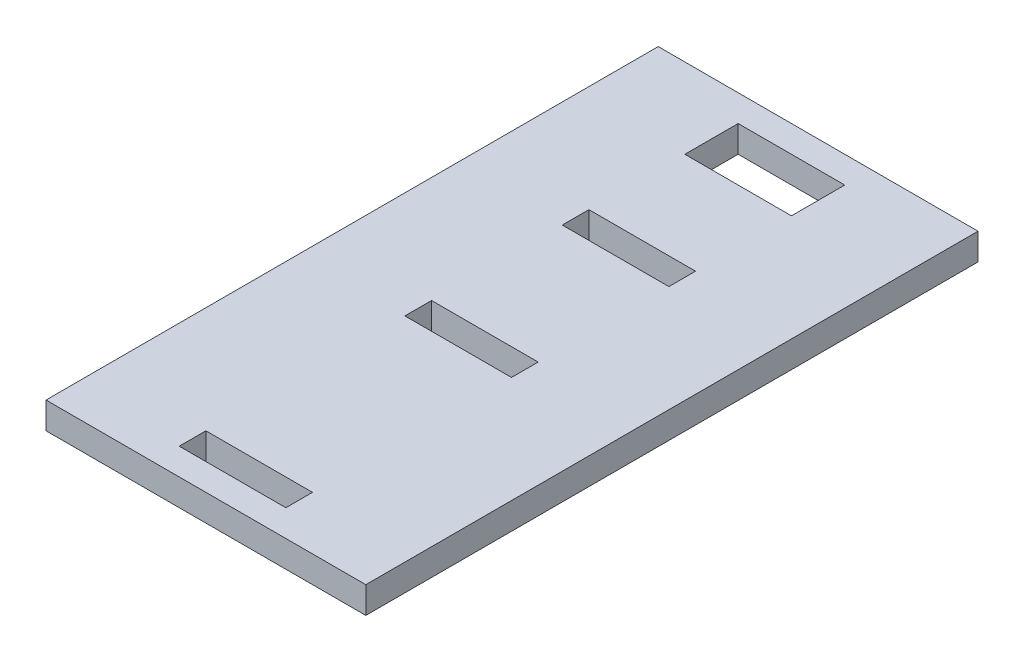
ISO-10303-21;
HEADER;
FILE_DESCRIPTION(('STEP AP214'),'2;1');
FILE_NAME('part.step','',(''),(''),'','','');
FILE_SCHEMA(('AUTOMOTIVE_DESIGN { 1 0 10303 214 1 1 1 1 }'));
ENDSEC;
DATA;
#1=APPLICATION_CONTEXT('core data for automotive mechanical design processes');
#2=APPLICATION_PROTOCOL_DEFINITION('international standard','automotive_design',2000,#1);
#3=PRODUCT_CONTEXT('',#1,'mechanical');
#4=PRODUCT('Part','Part','',(#3));
#5=PRODUCT_RELATED_PRODUCT_CATEGORY('part','',(#4));
#6=PRODUCT_DEFINITION_FORMATION('','',#4);
#7=PRODUCT_DEFINITION_CONTEXT('part definition',#1,'design');
#8=PRODUCT_DEFINITION('design','',#6,#7);
#9=PRODUCT_DEFINITION_SHAPE('','',#8);
#10=(LENGTH_UNIT() NAMED_UNIT(*) SI_UNIT(.MILLI.,.METRE.));
#11=(NAMED_UNIT(*) PLANE_ANGLE_UNIT() SI_UNIT($,.RADIAN.));
#12=(NAMED_UNIT(*) SI_UNIT($,.STERADIAN.) SOLID_ANGLE_UNIT());
#13=UNCERTAINTY_MEASURE_WITH_UNIT(LENGTH_MEASURE(1.E-05),#10,'distance_accuracy_value','');
#14=(GEOMETRIC_REPRESENTATION_CONTEXT(3) GLOBAL_UNCERTAINTY_ASSIGNED_CONTEXT((#13)) GLOBAL_UNIT_ASSIGNED_CONTEXT((#10,
#11,#12)) REPRESENTATION_CONTEXT('',''));
#15=CARTESIAN_POINT('',(0.,0.,0.));
#16=DIRECTION('',(0.,0.,1.));
#17=DIRECTION('',(1.,0.,0.));
#18=AXIS2_PLACEMENT_3D('',#15,#16,#17);
#19=CARTESIAN_POINT('',(0.,5.,0.));
#20=DIRECTION('',(0.,-1.,0.));
#21=DIRECTION('',(0.,0.,-1.));
#22=AXIS2_PLACEMENT_3D('',#19,#20,#21);
#23=PLANE('',#22);
#24=DIRECTION('',(0.,0.,1.));
#25=VECTOR('',#24,1.);
#26=CARTESIAN_POINT('',(19.99994,5.,-47.338));
#27=LINE('',#26,#25);
#28=CARTESIAN_POINT('',(19.99994,5.,-52.338));
#29=VERTEX_POINT('',#28);
#30=CARTESIAN_POINT('',(19.99994,5.,-47.338));
#31=VERTEX_POINT('',#30);
#32=EDGE_CURVE('E212',#29,#31,#27,.T.);
#33=ORIENTED_EDGE('',*,*,#32,.F.);
#34=DIRECTION('',(-1.,0.,0.));
#35=VECTOR('',#34,1.);
#36=CARTESIAN_POINT('',(19.99994,5.,-52.338));
#37=LINE('',#36,#35);
#38=CARTESIAN_POINT('',(39.99994,5.,-52.338));
#39=VERTEX_POINT('',#38);
#40=EDGE_CURVE('E220',#39,#29,#37,.T.);
#41=ORIENTED_EDGE('',*,*,#40,.F.);
#42=DIRECTION('',(0.,0.,-1.));
#43=VECTOR('',#42,1.);
#44=CARTESIAN_POINT('',(39.99994,5.,-47.338));
#45=LINE('',#44,#43);
#46=CARTESIAN_POINT('',(39.99994,5.,-47.338));
#47=VERTEX_POINT('',#46);
#48=EDGE_CURVE('E217',#47,#39,#45,.T.);
#49=ORIENTED_EDGE('',*,*,#48,.F.);
#50=DIRECTION('',(1.,0.,0.));
#51=VECTOR('',#50,1.);
#52=CARTESIAN_POINT('',(19.99994,5.,-47.338));
#53=LINE('',#52,#51);
#54=EDGE_CURVE('E214',#31,#47,#53,.T.);
#55=ORIENTED_EDGE('',*,*,#54,.F.);
#56=EDGE_LOOP('',(#33,#41,#49,#55));
#57=FACE_BOUND('',#56,.T.);
#58=DIRECTION('',(0.,0.,1.));
#59=VECTOR('',#58,1.);
#60=CARTESIAN_POINT('',(19.99994,5.,-109.8613654));
#61=LINE('',#60,#59);
#62=CARTESIAN_POINT('',(19.99994,5.,-109.8613654));
#63=VERTEX_POINT('',#62);
#64=CARTESIAN_POINT('',(19.99994,5.,-99.8613654));
#65=VERTEX_POINT('',#64);
#66=EDGE_CURVE('E274',#63,#65,#61,.T.);
#67=ORIENTED_EDGE('',*,*,#66,.F.);
#68=DIRECTION('',(-1.,0.,0.));
#69=VECTOR('',#68,1.);
#70=CARTESIAN_POINT('',(19.99994,5.,-109.8613654));
#71=LINE('',#70,#69);
#72=CARTESIAN_POINT('',(39.99994,5.,-109.8613654));
#73=VERTEX_POINT('',#72);
#74=EDGE_CURVE('E282',#73,#63,#71,.T.);
#75=ORIENTED_EDGE('',*,*,#74,.F.);
#76=DIRECTION('',(0.,0.,-1.));
#77=VECTOR('',#76,1.);
#78=CARTESIAN_POINT('',(39.99994,5.,-109.8613654));
#79=LINE('',#78,#77);
#80=CARTESIAN_POINT('',(39.99994,5.,-99.8613654));
#81=VERTEX_POINT('',#80);
#82=EDGE_CURVE('E279',#81,#73,#79,.T.);
#83=ORIENTED_EDGE('',*,*,#82,.F.);
#84=DIRECTION('',(1.,0.,0.));
#85=VECTOR('',#84,1.);
#86=CARTESIAN_POINT('',(19.99994,5.,-99.8613654));
#87=LINE('',#86,#85);
#88=EDGE_CURVE('E276',#65,#81,#87,.T.);
#89=ORIENTED_EDGE('',*,*,#88,.F.);
#90=EDGE_LOOP('',(#67,#75,#83,#89));
#91=FACE_BOUND('',#90,.T.);
#92=DIRECTION('',(0.,0.,1.));
#93=VECTOR('',#92,1.);
#94=CARTESIAN_POINT('',(0.,5.,0.));
#95=LINE('',#94,#93);
#96=CARTESIAN_POINT('',(0.,5.,-114.8613654));
#97=VERTEX_POINT('',#96);
#98=CARTESIAN_POINT('',(0.,5.,0.));
#99=VERTEX_POINT('',#98);
#100=EDGE_CURVE('E305',#97,#99,#95,.T.);
#101=ORIENTED_EDGE('',*,*,#100,.T.);
#102=DIRECTION('',(1.,0.,0.));
#103=VECTOR('',#102,1.);
#104=CARTESIAN_POINT('',(0.,5.,0.));
#105=LINE('',#104,#103);
#106=CARTESIAN_POINT('',(59.99988,5.,0.));
#107=VERTEX_POINT('',#106);
#108=EDGE_CURVE('E308',#99,#107,#105,.T.);
#109=ORIENTED_EDGE('',*,*,#108,.T.);
#110=DIRECTION('',(0.,0.,-1.));
#111=VECTOR('',#110,1.);
#112=CARTESIAN_POINT('',(59.99988,5.,0.));
#113=LINE('',#112,#111);
#114=CARTESIAN_POINT('',(59.99988,5.,-114.8613654));
#115=VERTEX_POINT('',#114);
#116=EDGE_CURVE('E311',#107,#115,#113,.T.);
#117=ORIENTED_EDGE('',*,*,#116,.T.);
#118=DIRECTION('',(-1.,0.,0.));
#119=VECTOR('',#118,1.);
#120=CARTESIAN_POINT('',(0.,5.,-114.8613654));
#121=LINE('',#120,#119);
#122=EDGE_CURVE('E313',#115,#97,#121,.T.);
#123=ORIENTED_EDGE('',*,*,#122,.T.);
#124=EDGE_LOOP('',(#101,#109,#117,#123));
#125=FACE_BOUND('',#124,.T.);
#126=DIRECTION('',(0.,0.,1.));
#127=VECTOR('',#126,1.);
#128=CARTESIAN_POINT('',(19.99994,5.,-5.));
#129=LINE('',#128,#127);
#130=CARTESIAN_POINT('',(19.99994,5.,-10.));
#131=VERTEX_POINT('',#130);
#132=CARTESIAN_POINT('',(19.99994,5.,-5.));
#133=VERTEX_POINT('',#132);
#134=EDGE_CURVE('E243',#131,#133,#129,.T.);
#135=ORIENTED_EDGE('',*,*,#134,.F.);
#136=DIRECTION('',(-1.,0.,0.));
#137=VECTOR('',#136,1.);
#138=CARTESIAN_POINT('',(19.99994,5.,-10.));
#139=LINE('',#138,#137);
#140=CARTESIAN_POINT('',(39.99994,5.,-10.));
#141=VERTEX_POINT('',#140);
#142=EDGE_CURVE('E251',#141,#131,#139,.T.);
#143=ORIENTED_EDGE('',*,*,#142,.F.);
#144=DIRECTION('',(0.,0.,-1.));
#145=VECTOR('',#144,1.);
#146=CARTESIAN_POINT('',(39.99994,5.,-5.));
#147=LINE('',#146,#145);
#148=CARTESIAN_POINT('',(39.99994,5.,-5.));
#149=VERTEX_POINT('',#148);
#150=EDGE_CURVE('E248',#149,#141,#147,.T.);
#151=ORIENTED_EDGE('',*,*,#150,.F.);
#152=DIRECTION('',(1.,0.,0.));
#153=VECTOR('',#152,1.);
#154=CARTESIAN_POINT('',(19.99994,5.,-5.));
#155=LINE('',#154,#153);
#156=EDGE_CURVE('E245',#133,#149,#155,.T.);
#157=ORIENTED_EDGE('',*,*,#156,.F.);
#158=EDGE_LOOP('',(#135,#143,#151,#157));
#159=FACE_BOUND('',#158,.T.);
#160=DIRECTION('',(0.,0.,1.));
#161=VECTOR('',#160,1.);
#162=CARTESIAN_POINT('',(19.99994,5.,-76.86424));
#163=LINE('',#162,#161);
#164=CARTESIAN_POINT('',(19.99994,5.,-81.86424));
#165=VERTEX_POINT('',#164);
#166=CARTESIAN_POINT('',(19.99994,5.,-76.86424));
#167=VERTEX_POINT('',#166);
#168=EDGE_CURVE('E176',#165,#167,#163,.T.);
#169=ORIENTED_EDGE('',*,*,#168,.F.);
#170=DIRECTION('',(-1.,0.,0.));
#171=VECTOR('',#170,1.);
#172=CARTESIAN_POINT('',(19.99994,5.,-81.86424));
#173=LINE('',#172,#171);
#174=CARTESIAN_POINT('',(39.99994,5.,-81.86424));
#175=VERTEX_POINT('',#174);
#176=EDGE_CURVE('E198',#175,#165,#173,.T.);
#177=ORIENTED_EDGE('',*,*,#176,.F.);
#178=DIRECTION('',(0.,0.,-1.));
#179=VECTOR('',#178,1.);
#180=CARTESIAN_POINT('',(39.99994,5.,-76.86424));
#181=LINE('',#180,#179);
#182=CARTESIAN_POINT('',(39.99994,5.,-76.86424));
#183=VERTEX_POINT('',#182);
#184=EDGE_CURVE('E196',#183,#175,#181,.T.);
#185=ORIENTED_EDGE('',*,*,#184,.F.);
#186=DIRECTION('',(1.,0.,0.));
#187=VECTOR('',#186,1.);
#188=CARTESIAN_POINT('',(19.99994,5.,-76.86424));
#189=LINE('',#188,#187);
#190=EDGE_CURVE('E184',#167,#183,#189,.T.);
#191=ORIENTED_EDGE('',*,*,#190,.F.);
#192=EDGE_LOOP('',(#169,#177,#185,#191));
#193=FACE_BOUND('',#192,.T.);
#194=ADVANCED_FACE('F39',(#57,#91,#125,#159,#193),#23,.F.);
#195=CARTESIAN_POINT('',(0.,0.,0.));
#196=DIRECTION('',(0.,-1.,0.));
#197=DIRECTION('',(0.,0.,-1.));
#198=AXIS2_PLACEMENT_3D('',#195,#196,#197);
#199=PLANE('',#198);
#200=DIRECTION('',(0.,0.,1.));
#201=VECTOR('',#200,1.);
#202=CARTESIAN_POINT('',(0.,0.,0.));
#203=LINE('',#202,#201);
#204=CARTESIAN_POINT('',(0.,0.,-114.8613654));
#205=VERTEX_POINT('',#204);
#206=CARTESIAN_POINT('',(0.,0.,0.));
#207=VERTEX_POINT('',#206);
#208=EDGE_CURVE('E304',#205,#207,#203,.T.);
#209=ORIENTED_EDGE('',*,*,#208,.F.);
#210=DIRECTION('',(-1.,0.,0.));
#211=VECTOR('',#210,1.);
#212=CARTESIAN_POINT('',(0.,0.,-114.8613654));
#213=LINE('',#212,#211);
#214=CARTESIAN_POINT('',(59.99988,0.,-114.8613654));
#215=VERTEX_POINT('',#214);
#216=EDGE_CURVE('E309',#215,#205,#213,.T.);
#217=ORIENTED_EDGE('',*,*,#216,.F.);
#218=DIRECTION('',(0.,0.,-1.));
#219=VECTOR('',#218,1.);
#220=CARTESIAN_POINT('',(59.99988,0.,0.));
#221=LINE('',#220,#219);
#222=CARTESIAN_POINT('',(59.99988,0.,0.));
#223=VERTEX_POINT('',#222);
#224=EDGE_CURVE('E320',#223,#215,#221,.T.);
#225=ORIENTED_EDGE('',*,*,#224,.F.);
#226=DIRECTION('',(1.,0.,0.));
#227=VECTOR('',#226,1.);
#228=CARTESIAN_POINT('',(0.,0.,0.));
#229=LINE('',#228,#227);
#230=EDGE_CURVE('E318',#207,#223,#229,.T.);
#231=ORIENTED_EDGE('',*,*,#230,.F.);
#232=EDGE_LOOP('',(#209,#217,#225,#231));
#233=FACE_BOUND('',#232,.T.);
#234=DIRECTION('',(-1.,0.,0.));
#235=VECTOR('',#234,1.);
#236=CARTESIAN_POINT('',(19.99994,0.,-109.8613654));
#237=LINE('',#236,#235);
#238=CARTESIAN_POINT('',(39.99994,0.,-109.8613654));
#239=VERTEX_POINT('',#238);
#240=CARTESIAN_POINT('',(19.99994,0.,-109.8613654));
#241=VERTEX_POINT('',#240);
#242=EDGE_CURVE('E277',#239,#241,#237,.T.);
#243=ORIENTED_EDGE('',*,*,#242,.T.);
#244=DIRECTION('',(0.,0.,1.));
#245=VECTOR('',#244,1.);
#246=CARTESIAN_POINT('',(19.99994,0.,-109.8613654));
#247=LINE('',#246,#245);
#248=CARTESIAN_POINT('',(19.99994,0.,-99.8613654));
#249=VERTEX_POINT('',#248);
#250=EDGE_CURVE('E273',#241,#249,#247,.T.);
#251=ORIENTED_EDGE('',*,*,#250,.T.);
#252=DIRECTION('',(1.,0.,0.));
#253=VECTOR('',#252,1.);
#254=CARTESIAN_POINT('',(19.99994,0.,-99.8613654));
#255=LINE('',#254,#253);
#256=CARTESIAN_POINT('',(39.99994,0.,-99.8613654));
#257=VERTEX_POINT('',#256);
#258=EDGE_CURVE('E287',#249,#257,#255,.T.);
#259=ORIENTED_EDGE('',*,*,#258,.T.);
#260=DIRECTION('',(0.,0.,-1.));
#261=VECTOR('',#260,1.);
#262=CARTESIAN_POINT('',(39.99994,0.,-109.8613654));
#263=LINE('',#262,#261);
#264=EDGE_CURVE('E290',#257,#239,#263,.T.);
#265=ORIENTED_EDGE('',*,*,#264,.T.);
#266=EDGE_LOOP('',(#243,#251,#259,#265));
#267=FACE_BOUND('',#266,.T.);
#268=DIRECTION('',(-1.,0.,0.));
#269=VECTOR('',#268,1.);
#270=CARTESIAN_POINT('',(19.99994,0.,-10.));
#271=LINE('',#270,#269);
#272=CARTESIAN_POINT('',(39.99994,0.,-10.));
#273=VERTEX_POINT('',#272);
#274=CARTESIAN_POINT('',(19.99994,0.,-10.));
#275=VERTEX_POINT('',#274);
#276=EDGE_CURVE('E246',#273,#275,#271,.T.);
#277=ORIENTED_EDGE('',*,*,#276,.T.);
#278=DIRECTION('',(0.,0.,1.));
#279=VECTOR('',#278,1.);
#280=CARTESIAN_POINT('',(19.99994,0.,-5.));
#281=LINE('',#280,#279);
#282=CARTESIAN_POINT('',(19.99994,0.,-5.));
#283=VERTEX_POINT('',#282);
#284=EDGE_CURVE('E242',#275,#283,#281,.T.);
#285=ORIENTED_EDGE('',*,*,#284,.T.);
#286=DIRECTION('',(1.,0.,0.));
#287=VECTOR('',#286,1.);
#288=CARTESIAN_POINT('',(19.99994,0.,-5.));
#289=LINE('',#288,#287);
#290=CARTESIAN_POINT('',(39.99994,0.,-5.));
#291=VERTEX_POINT('',#290);
#292=EDGE_CURVE('E256',#283,#291,#289,.T.);
#293=ORIENTED_EDGE('',*,*,#292,.T.);
#294=DIRECTION('',(0.,0.,-1.));
#295=VECTOR('',#294,1.);
#296=CARTESIAN_POINT('',(39.99994,0.,-5.));
#297=LINE('',#296,#295);
#298=EDGE_CURVE('E259',#291,#273,#297,.T.);
#299=ORIENTED_EDGE('',*,*,#298,.T.);
#300=EDGE_LOOP('',(#277,#285,#293,#299));
#301=FACE_BOUND('',#300,.T.);
#302=DIRECTION('',(-1.,0.,0.));
#303=VECTOR('',#302,1.);
#304=CARTESIAN_POINT('',(19.99994,0.,-52.338));
#305=LINE('',#304,#303);
#306=CARTESIAN_POINT('',(39.99994,0.,-52.338));
#307=VERTEX_POINT('',#306);
#308=CARTESIAN_POINT('',(19.99994,0.,-52.338));
#309=VERTEX_POINT('',#308);
#310=EDGE_CURVE('E215',#307,#309,#305,.T.);
#311=ORIENTED_EDGE('',*,*,#310,.T.);
#312=DIRECTION('',(0.,0.,1.));
#313=VECTOR('',#312,1.);
#314=CARTESIAN_POINT('',(19.99994,0.,-47.338));
#315=LINE('',#314,#313);
#316=CARTESIAN_POINT('',(19.99994,0.,-47.338));
#317=VERTEX_POINT('',#316);
#318=EDGE_CURVE('E192',#309,#317,#315,.T.);
#319=ORIENTED_EDGE('',*,*,#318,.T.);
#320=DIRECTION('',(1.,0.,0.));
#321=VECTOR('',#320,1.);
#322=CARTESIAN_POINT('',(19.99994,0.,-47.338));
#323=LINE('',#322,#321);
#324=CARTESIAN_POINT('',(39.99994,0.,-47.338));
#325=VERTEX_POINT('',#324);
#326=EDGE_CURVE('E225',#317,#325,#323,.T.);
#327=ORIENTED_EDGE('',*,*,#326,.T.);
#328=DIRECTION('',(0.,0.,-1.));
#329=VECTOR('',#328,1.);
#330=CARTESIAN_POINT('',(39.99994,0.,-47.338));
#331=LINE('',#330,#329);
#332=EDGE_CURVE('E228',#325,#307,#331,.T.);
#333=ORIENTED_EDGE('',*,*,#332,.T.);
#334=EDGE_LOOP('',(#311,#319,#327,#333));
#335=FACE_BOUND('',#334,.T.);
#336=DIRECTION('',(-1.,0.,0.));
#337=VECTOR('',#336,1.);
#338=CARTESIAN_POINT('',(19.99994,0.,-81.86424));
#339=LINE('',#338,#337);
#340=CARTESIAN_POINT('',(39.99994,0.,-81.86424));
#341=VERTEX_POINT('',#340);
#342=CARTESIAN_POINT('',(19.99994,0.,-81.86424));
#343=VERTEX_POINT('',#342);
#344=EDGE_CURVE('E185',#341,#343,#339,.T.);
#345=ORIENTED_EDGE('',*,*,#344,.T.);
#346=DIRECTION('',(0.,0.,1.));
#347=VECTOR('',#346,1.);
#348=CARTESIAN_POINT('',(19.99994,0.,-76.86424));
#349=LINE('',#348,#347);
#350=CARTESIAN_POINT('',(19.99994,0.,-76.86424));
#351=VERTEX_POINT('',#350);
#352=EDGE_CURVE('E62',#343,#351,#349,.T.);
#353=ORIENTED_EDGE('',*,*,#352,.T.);
#354=DIRECTION('',(1.,0.,0.));
#355=VECTOR('',#354,1.);
#356=CARTESIAN_POINT('',(19.99994,0.,-76.86424));
#357=LINE('',#356,#355);
#358=CARTESIAN_POINT('',(39.99994,0.,-76.86424));
#359=VERTEX_POINT('',#358);
#360=EDGE_CURVE('E191',#351,#359,#357,.T.);
#361=ORIENTED_EDGE('',*,*,#360,.T.);
#362=DIRECTION('',(0.,0.,-1.));
#363=VECTOR('',#362,1.);
#364=CARTESIAN_POINT('',(39.99994,0.,-76.86424));
#365=LINE('',#364,#363);
#366=EDGE_CURVE('E204',#359,#341,#365,.T.);
#367=ORIENTED_EDGE('',*,*,#366,.T.);
#368=EDGE_LOOP('',(#345,#353,#361,#367));
#369=FACE_BOUND('',#368,.T.);
#370=ADVANCED_FACE('F338',(#233,#267,#301,#335,#369),#199,.T.);
#371=CARTESIAN_POINT('',(0.,5.,0.));
#372=DIRECTION('',(1.,0.,0.));
#373=DIRECTION('',(0.,0.,-1.));
#374=AXIS2_PLACEMENT_3D('',#371,#372,#373);
#375=PLANE('',#374);
#376=ORIENTED_EDGE('',*,*,#208,.T.);
#377=DIRECTION('',(0.,-1.,0.));
#378=VECTOR('',#377,1.);
#379=CARTESIAN_POINT('',(0.,5.,0.));
#380=LINE('',#379,#378);
#381=EDGE_CURVE('E11',#99,#207,#380,.T.);
#382=ORIENTED_EDGE('',*,*,#381,.F.);
#383=ORIENTED_EDGE('',*,*,#100,.F.);
#384=DIRECTION('',(0.,-1.,0.));
#385=VECTOR('',#384,1.);
#386=CARTESIAN_POINT('',(0.,5.,-114.8613654));
#387=LINE('',#386,#385);
#388=EDGE_CURVE('E315',#97,#205,#387,.T.);
#389=ORIENTED_EDGE('',*,*,#388,.T.);
#390=EDGE_LOOP('',(#376,#382,#383,#389));
#391=FACE_BOUND('',#390,.T.);
#392=ADVANCED_FACE('F41',(#391),#375,.F.);
#393=CARTESIAN_POINT('',(0.,5.,0.));
#394=DIRECTION('',(0.,0.,-1.));
#395=DIRECTION('',(-1.,0.,0.));
#396=AXIS2_PLACEMENT_3D('',#393,#394,#395);
#397=PLANE('',#396);
#398=ORIENTED_EDGE('',*,*,#230,.T.);
#399=DIRECTION('',(0.,-1.,0.));
#400=VECTOR('',#399,1.);
#401=CARTESIAN_POINT('',(59.99988,5.,0.));
#402=LINE('',#401,#400);
#403=EDGE_CURVE('E47',#107,#223,#402,.T.);
#404=ORIENTED_EDGE('',*,*,#403,.F.);
#405=ORIENTED_EDGE('',*,*,#108,.F.);
#406=ORIENTED_EDGE('',*,*,#381,.T.);
#407=EDGE_LOOP('',(#398,#404,#405,#406));
#408=FACE_BOUND('',#407,.T.);
#409=ADVANCED_FACE('F349',(#408),#397,.F.);
#410=CARTESIAN_POINT('',(59.99988,5.,0.));
#411=DIRECTION('',(-1.,0.,0.));
#412=DIRECTION('',(0.,0.,1.));
#413=AXIS2_PLACEMENT_3D('',#410,#411,#412);
#414=PLANE('',#413);
#415=ORIENTED_EDGE('',*,*,#224,.T.);
#416=DIRECTION('',(0.,-1.,0.));
#417=VECTOR('',#416,1.);
#418=CARTESIAN_POINT('',(59.99988,5.,-114.8613654));
#419=LINE('',#418,#417);
#420=EDGE_CURVE('E325',#115,#215,#419,.T.);
#421=ORIENTED_EDGE('',*,*,#420,.F.);
#422=ORIENTED_EDGE('',*,*,#116,.F.);
#423=ORIENTED_EDGE('',*,*,#403,.T.);
#424=EDGE_LOOP('',(#415,#421,#422,#423));
#425=FACE_BOUND('',#424,.T.);
#426=ADVANCED_FACE('F332',(#425),#414,.F.);
#427=CARTESIAN_POINT('',(0.,5.,-114.8613654));
#428=DIRECTION('',(0.,0.,1.));
#429=DIRECTION('',(1.,0.,0.));
#430=AXIS2_PLACEMENT_3D('',#427,#428,#429);
#431=PLANE('',#430);
#432=ORIENTED_EDGE('',*,*,#216,.T.);
#433=ORIENTED_EDGE('',*,*,#388,.F.);
#434=ORIENTED_EDGE('',*,*,#122,.F.);
#435=ORIENTED_EDGE('',*,*,#420,.T.);
#436=EDGE_LOOP('',(#432,#433,#434,#435));
#437=FACE_BOUND('',#436,.T.);
#438=ADVANCED_FACE('F342',(#437),#431,.F.);
#439=CARTESIAN_POINT('',(19.99994,5.,-109.8613654));
#440=DIRECTION('',(1.,0.,0.));
#441=DIRECTION('',(0.,0.,-1.));
#442=AXIS2_PLACEMENT_3D('',#439,#440,#441);
#443=PLANE('',#442);
#444=ORIENTED_EDGE('',*,*,#250,.F.);
#445=DIRECTION('',(0.,-1.,0.));
#446=VECTOR('',#445,1.);
#447=CARTESIAN_POINT('',(19.99994,5.,-109.8613654));
#448=LINE('',#447,#446);
#449=EDGE_CURVE('E284',#63,#241,#448,.T.);
#450=ORIENTED_EDGE('',*,*,#449,.F.);
#451=ORIENTED_EDGE('',*,*,#66,.T.);
#452=DIRECTION('',(0.,-1.,0.));
#453=VECTOR('',#452,1.);
#454=CARTESIAN_POINT('',(19.99994,5.,-99.8613654));
#455=LINE('',#454,#453);
#456=EDGE_CURVE('E301',#65,#249,#455,.T.);
#457=ORIENTED_EDGE('',*,*,#456,.T.);
#458=EDGE_LOOP('',(#444,#450,#451,#457));
#459=FACE_BOUND('',#458,.T.);
#460=ADVANCED_FACE('F366',(#459),#443,.T.);
#461=CARTESIAN_POINT('',(19.99994,5.,-99.8613654));
#462=DIRECTION('',(0.,0.,-1.));
#463=DIRECTION('',(-1.,0.,0.));
#464=AXIS2_PLACEMENT_3D('',#461,#462,#463);
#465=PLANE('',#464);
#466=ORIENTED_EDGE('',*,*,#258,.F.);
#467=ORIENTED_EDGE('',*,*,#456,.F.);
#468=ORIENTED_EDGE('',*,*,#88,.T.);
#469=DIRECTION('',(0.,-1.,0.));
#470=VECTOR('',#469,1.);
#471=CARTESIAN_POINT('',(39.99994,5.,-99.8613654));
#472=LINE('',#471,#470);
#473=EDGE_CURVE('E299',#81,#257,#472,.T.);
#474=ORIENTED_EDGE('',*,*,#473,.T.);
#475=EDGE_LOOP('',(#466,#467,#468,#474));
#476=FACE_BOUND('',#475,.T.);
#477=ADVANCED_FACE('F373',(#476),#465,.T.);
#478=CARTESIAN_POINT('',(39.99994,5.,-109.8613654));
#479=DIRECTION('',(-1.,0.,0.));
#480=DIRECTION('',(0.,0.,1.));
#481=AXIS2_PLACEMENT_3D('',#478,#479,#480);
#482=PLANE('',#481);
#483=ORIENTED_EDGE('',*,*,#264,.F.);
#484=ORIENTED_EDGE('',*,*,#473,.F.);
#485=ORIENTED_EDGE('',*,*,#82,.T.);
#486=DIRECTION('',(0.,-1.,0.));
#487=VECTOR('',#486,1.);
#488=CARTESIAN_POINT('',(39.99994,5.,-109.8613654));
#489=LINE('',#488,#487);
#490=EDGE_CURVE('E297',#73,#239,#489,.T.);
#491=ORIENTED_EDGE('',*,*,#490,.T.);
#492=EDGE_LOOP('',(#483,#484,#485,#491));
#493=FACE_BOUND('',#492,.T.);
#494=ADVANCED_FACE('F378',(#493),#482,.T.);
#495=CARTESIAN_POINT('',(19.99994,5.,-109.8613654));
#496=DIRECTION('',(0.,0.,1.));
#497=DIRECTION('',(1.,0.,0.));
#498=AXIS2_PLACEMENT_3D('',#495,#496,#497);
#499=PLANE('',#498);
#500=ORIENTED_EDGE('',*,*,#242,.F.);
#501=ORIENTED_EDGE('',*,*,#490,.F.);
#502=ORIENTED_EDGE('',*,*,#74,.T.);
#503=ORIENTED_EDGE('',*,*,#449,.T.);
#504=EDGE_LOOP('',(#500,#501,#502,#503));
#505=FACE_BOUND('',#504,.T.);
#506=ADVANCED_FACE('F385',(#505),#499,.T.);
#507=CARTESIAN_POINT('',(19.99994,5.,-5.));
#508=DIRECTION('',(1.,0.,0.));
#509=DIRECTION('',(0.,0.,-1.));
#510=AXIS2_PLACEMENT_3D('',#507,#508,#509);
#511=PLANE('',#510);
#512=ORIENTED_EDGE('',*,*,#284,.F.);
#513=DIRECTION('',(0.,-1.,0.));
#514=VECTOR('',#513,1.);
#515=CARTESIAN_POINT('',(19.99994,5.,-10.));
#516=LINE('',#515,#514);
#517=EDGE_CURVE('E253',#131,#275,#516,.T.);
#518=ORIENTED_EDGE('',*,*,#517,.F.);
#519=ORIENTED_EDGE('',*,*,#134,.T.);
#520=DIRECTION('',(0.,-1.,0.));
#521=VECTOR('',#520,1.);
#522=CARTESIAN_POINT('',(19.99994,5.,-5.));
#523=LINE('',#522,#521);
#524=EDGE_CURVE('E270',#133,#283,#523,.T.);
#525=ORIENTED_EDGE('',*,*,#524,.T.);
#526=EDGE_LOOP('',(#512,#518,#519,#525));
#527=FACE_BOUND('',#526,.T.);
#528=ADVANCED_FACE('F398',(#527),#511,.T.);
#529=CARTESIAN_POINT('',(19.99994,5.,-5.));
#530=DIRECTION('',(0.,0.,-1.));
#531=DIRECTION('',(-1.,0.,0.));
#532=AXIS2_PLACEMENT_3D('',#529,#530,#531);
#533=PLANE('',#532);
#534=ORIENTED_EDGE('',*,*,#292,.F.);
#535=ORIENTED_EDGE('',*,*,#524,.F.);
#536=ORIENTED_EDGE('',*,*,#156,.T.);
#537=DIRECTION('',(0.,-1.,0.));
#538=VECTOR('',#537,1.);
#539=CARTESIAN_POINT('',(39.99994,5.,-5.));
#540=LINE('',#539,#538);
#541=EDGE_CURVE('E268',#149,#291,#540,.T.);
#542=ORIENTED_EDGE('',*,*,#541,.T.);
#543=EDGE_LOOP('',(#534,#535,#536,#542));
#544=FACE_BOUND('',#543,.T.);
#545=ADVANCED_FACE('F403',(#544),#533,.T.);
#546=CARTESIAN_POINT('',(39.99994,5.,-5.));
#547=DIRECTION('',(-1.,0.,0.));
#548=DIRECTION('',(0.,0.,1.));
#549=AXIS2_PLACEMENT_3D('',#546,#547,#548);
#550=PLANE('',#549);
#551=ORIENTED_EDGE('',*,*,#298,.F.);
#552=ORIENTED_EDGE('',*,*,#541,.F.);
#553=ORIENTED_EDGE('',*,*,#150,.T.);
#554=DIRECTION('',(0.,-1.,0.));
#555=VECTOR('',#554,1.);
#556=CARTESIAN_POINT('',(39.99994,5.,-10.));
#557=LINE('',#556,#555);
#558=EDGE_CURVE('E266',#141,#273,#557,.T.);
#559=ORIENTED_EDGE('',*,*,#558,.T.);
#560=EDGE_LOOP('',(#551,#552,#553,#559));
#561=FACE_BOUND('',#560,.T.);
#562=ADVANCED_FACE('F407',(#561),#550,.T.);
#563=CARTESIAN_POINT('',(19.99994,5.,-10.));
#564=DIRECTION('',(0.,0.,1.));
#565=DIRECTION('',(1.,0.,0.));
#566=AXIS2_PLACEMENT_3D('',#563,#564,#565);
#567=PLANE('',#566);
#568=ORIENTED_EDGE('',*,*,#276,.F.);
#569=ORIENTED_EDGE('',*,*,#558,.F.);
#570=ORIENTED_EDGE('',*,*,#142,.T.);
#571=ORIENTED_EDGE('',*,*,#517,.T.);
#572=EDGE_LOOP('',(#568,#569,#570,#571));
#573=FACE_BOUND('',#572,.T.);
#574=ADVANCED_FACE('F411',(#573),#567,.T.);
#575=CARTESIAN_POINT('',(19.99994,5.,-47.338));
#576=DIRECTION('',(1.,0.,0.));
#577=DIRECTION('',(0.,0.,-1.));
#578=AXIS2_PLACEMENT_3D('',#575,#576,#577);
#579=PLANE('',#578);
#580=ORIENTED_EDGE('',*,*,#318,.F.);
#581=DIRECTION('',(0.,-1.,0.));
#582=VECTOR('',#581,1.);
#583=CARTESIAN_POINT('',(19.99994,5.,-52.338));
#584=LINE('',#583,#582);
#585=EDGE_CURVE('E222',#29,#309,#584,.T.);
#586=ORIENTED_EDGE('',*,*,#585,.F.);
#587=ORIENTED_EDGE('',*,*,#32,.T.);
#588=DIRECTION('',(0.,-1.,0.));
#589=VECTOR('',#588,1.);
#590=CARTESIAN_POINT('',(19.99994,5.,-47.338));
#591=LINE('',#590,#589);
#592=EDGE_CURVE('E239',#31,#317,#591,.T.);
#593=ORIENTED_EDGE('',*,*,#592,.T.);
#594=EDGE_LOOP('',(#580,#586,#587,#593));
#595=FACE_BOUND('',#594,.T.);
#596=ADVANCED_FACE('F415',(#595),#579,.T.);
#597=CARTESIAN_POINT('',(19.99994,5.,-47.338));
#598=DIRECTION('',(0.,0.,-1.));
#599=DIRECTION('',(-1.,0.,0.));
#600=AXIS2_PLACEMENT_3D('',#597,#598,#599);
#601=PLANE('',#600);
#602=ORIENTED_EDGE('',*,*,#326,.F.);
#603=ORIENTED_EDGE('',*,*,#592,.F.);
#604=ORIENTED_EDGE('',*,*,#54,.T.);
#605=DIRECTION('',(0.,-1.,0.));
#606=VECTOR('',#605,1.);
#607=CARTESIAN_POINT('',(39.99994,5.,-47.338));
#608=LINE('',#607,#606);
#609=EDGE_CURVE('E237',#47,#325,#608,.T.);
#610=ORIENTED_EDGE('',*,*,#609,.T.);
#611=EDGE_LOOP('',(#602,#603,#604,#610));
#612=FACE_BOUND('',#611,.T.);
#613=ADVANCED_FACE('F419',(#612),#601,.T.);
#614=CARTESIAN_POINT('',(39.99994,5.,-47.338));
#615=DIRECTION('',(-1.,0.,0.));
#616=DIRECTION('',(0.,0.,1.));
#617=AXIS2_PLACEMENT_3D('',#614,#615,#616);
#618=PLANE('',#617);
#619=ORIENTED_EDGE('',*,*,#332,.F.);
#620=ORIENTED_EDGE('',*,*,#609,.F.);
#621=ORIENTED_EDGE('',*,*,#48,.T.);
#622=DIRECTION('',(0.,-1.,0.));
#623=VECTOR('',#622,1.);
#624=CARTESIAN_POINT('',(39.99994,5.,-52.338));
#625=LINE('',#624,#623);
#626=EDGE_CURVE('E235',#39,#307,#625,.T.);
#627=ORIENTED_EDGE('',*,*,#626,.T.);
#628=EDGE_LOOP('',(#619,#620,#621,#627));
#629=FACE_BOUND('',#628,.T.);
#630=ADVANCED_FACE('F423',(#629),#618,.T.);
#631=CARTESIAN_POINT('',(19.99994,5.,-52.338));
#632=DIRECTION('',(0.,0.,1.));
#633=DIRECTION('',(1.,0.,0.));
#634=AXIS2_PLACEMENT_3D('',#631,#632,#633);
#635=PLANE('',#634);
#636=ORIENTED_EDGE('',*,*,#310,.F.);
#637=ORIENTED_EDGE('',*,*,#626,.F.);
#638=ORIENTED_EDGE('',*,*,#40,.T.);
#639=ORIENTED_EDGE('',*,*,#585,.T.);
#640=EDGE_LOOP('',(#636,#637,#638,#639));
#641=FACE_BOUND('',#640,.T.);
#642=ADVANCED_FACE('F427',(#641),#635,.T.);
#643=CARTESIAN_POINT('',(19.99994,5.,-76.86424));
#644=DIRECTION('',(1.,0.,0.));
#645=DIRECTION('',(0.,0.,-1.));
#646=AXIS2_PLACEMENT_3D('',#643,#644,#645);
#647=PLANE('',#646);
#648=ORIENTED_EDGE('',*,*,#352,.F.);
#649=DIRECTION('',(0.,-1.,0.));
#650=VECTOR('',#649,1.);
#651=CARTESIAN_POINT('',(19.99994,5.,-81.86424));
#652=LINE('',#651,#650);
#653=EDGE_CURVE('E180',#165,#343,#652,.T.);
#654=ORIENTED_EDGE('',*,*,#653,.F.);
#655=ORIENTED_EDGE('',*,*,#168,.T.);
#656=DIRECTION('',(0.,-1.,0.));
#657=VECTOR('',#656,1.);
#658=CARTESIAN_POINT('',(19.99994,5.,-76.86424));
#659=LINE('',#658,#657);
#660=EDGE_CURVE('E179',#167,#351,#659,.T.);
#661=ORIENTED_EDGE('',*,*,#660,.T.);
#662=EDGE_LOOP('',(#648,#654,#655,#661));
#663=FACE_BOUND('',#662,.T.);
#664=ADVANCED_FACE('F178',(#663),#647,.T.);
#665=CARTESIAN_POINT('',(19.99994,5.,-76.86424));
#666=DIRECTION('',(0.,0.,-1.));
#667=DIRECTION('',(-1.,0.,0.));
#668=AXIS2_PLACEMENT_3D('',#665,#666,#667);
#669=PLANE('',#668);
#670=ORIENTED_EDGE('',*,*,#360,.F.);
#671=ORIENTED_EDGE('',*,*,#660,.F.);
#672=ORIENTED_EDGE('',*,*,#190,.T.);
#673=DIRECTION('',(0.,-1.,0.));
#674=VECTOR('',#673,1.);
#675=CARTESIAN_POINT('',(39.99994,5.,-76.86424));
#676=LINE('',#675,#674);
#677=EDGE_CURVE('E193',#183,#359,#676,.T.);
#678=ORIENTED_EDGE('',*,*,#677,.T.);
#679=EDGE_LOOP('',(#670,#671,#672,#678));
#680=FACE_BOUND('',#679,.T.);
#681=ADVANCED_FACE('F188',(#680),#669,.T.);
#682=CARTESIAN_POINT('',(39.99994,5.,-76.86424));
#683=DIRECTION('',(-1.,0.,0.));
#684=DIRECTION('',(0.,0.,1.));
#685=AXIS2_PLACEMENT_3D('',#682,#683,#684);
#686=PLANE('',#685);
#687=ORIENTED_EDGE('',*,*,#366,.F.);
#688=ORIENTED_EDGE('',*,*,#677,.F.);
#689=ORIENTED_EDGE('',*,*,#184,.T.);
#690=DIRECTION('',(0.,-1.,0.));
#691=VECTOR('',#690,1.);
#692=CARTESIAN_POINT('',(39.99994,5.,-81.86424));
#693=LINE('',#692,#691);
#694=EDGE_CURVE('E54',#175,#341,#693,.T.);
#695=ORIENTED_EDGE('',*,*,#694,.T.);
#696=EDGE_LOOP('',(#687,#688,#689,#695));
#697=FACE_BOUND('',#696,.T.);
#698=ADVANCED_FACE('F436',(#697),#686,.T.);
#699=CARTESIAN_POINT('',(19.99994,5.,-81.86424));
#700=DIRECTION('',(0.,0.,1.));
#701=DIRECTION('',(1.,0.,0.));
#702=AXIS2_PLACEMENT_3D('',#699,#700,#701);
#703=PLANE('',#702);
#704=ORIENTED_EDGE('',*,*,#344,.F.);
#705=ORIENTED_EDGE('',*,*,#694,.F.);
#706=ORIENTED_EDGE('',*,*,#176,.T.);
#707=ORIENTED_EDGE('',*,*,#653,.T.);
#708=EDGE_LOOP('',(#704,#705,#706,#707));
#709=FACE_BOUND('',#708,.T.);
#710=ADVANCED_FACE('F439',(#709),#703,.T.);
#711=CLOSED_SHELL('',(#194,#370,#392,#409,#426,#438,#460,#477,#494,#506,#528,#545,#562,#574,
#596,#613,#630,#642,#664,#681,#698,#710));
#712=MANIFOLD_SOLID_BREP('B2',#711);
#713=ADVANCED_BREP_SHAPE_REPRESENTATION('',(#18,#712),#14);
#714=SHAPE_DEFINITION_REPRESENTATION(#9,#713);
ENDSEC;
END-ISO-10303-21;
